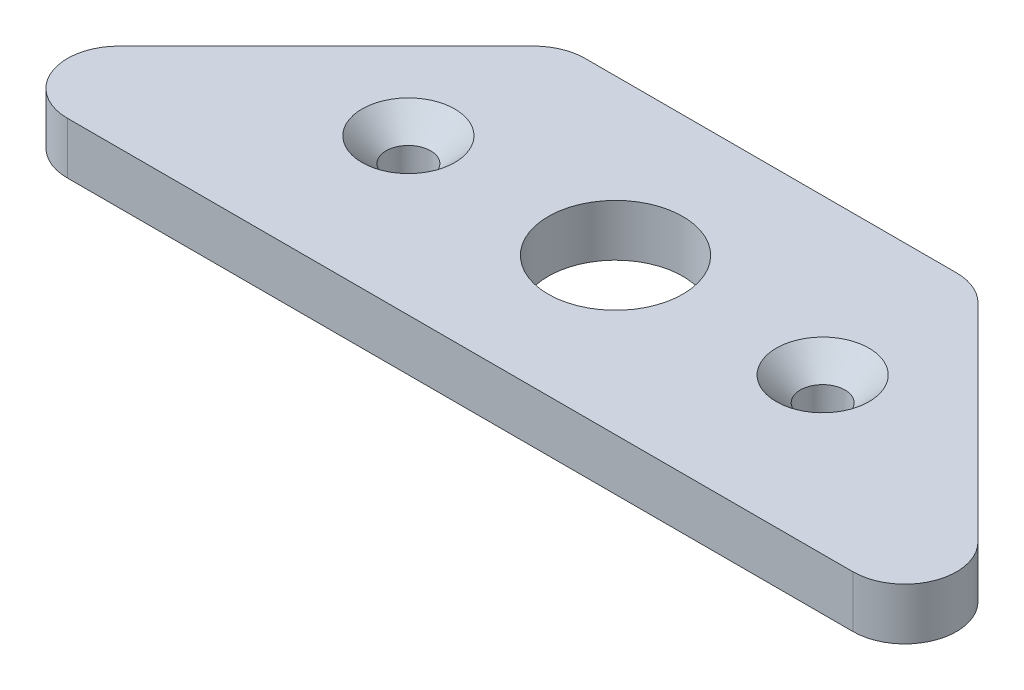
ISO-10303-21;
HEADER;
FILE_DESCRIPTION(('STEP AP214'),'2;1');
FILE_NAME('part.step','',(''),(''),'','','');
FILE_SCHEMA(('AUTOMOTIVE_DESIGN { 1 0 10303 214 1 1 1 1 }'));
ENDSEC;
DATA;
#1=APPLICATION_CONTEXT('core data for automotive mechanical design processes');
#2=APPLICATION_PROTOCOL_DEFINITION('international standard','automotive_design',2000,#1);
#3=PRODUCT_CONTEXT('',#1,'mechanical');
#4=PRODUCT('Part','Part','',(#3));
#5=PRODUCT_RELATED_PRODUCT_CATEGORY('part','',(#4));
#6=PRODUCT_DEFINITION_FORMATION('','',#4);
#7=PRODUCT_DEFINITION_CONTEXT('part definition',#1,'design');
#8=PRODUCT_DEFINITION('design','',#6,#7);
#9=PRODUCT_DEFINITION_SHAPE('','',#8);
#10=(LENGTH_UNIT() NAMED_UNIT(*) SI_UNIT(.MILLI.,.METRE.));
#11=(NAMED_UNIT(*) PLANE_ANGLE_UNIT() SI_UNIT($,.RADIAN.));
#12=(NAMED_UNIT(*) SI_UNIT($,.STERADIAN.) SOLID_ANGLE_UNIT());
#13=UNCERTAINTY_MEASURE_WITH_UNIT(LENGTH_MEASURE(1.E-05),#10,'distance_accuracy_value','');
#14=(GEOMETRIC_REPRESENTATION_CONTEXT(3) GLOBAL_UNCERTAINTY_ASSIGNED_CONTEXT((#13)) GLOBAL_UNIT_ASSIGNED_CONTEXT((#10,
#11,#12)) REPRESENTATION_CONTEXT('',''));
#15=CARTESIAN_POINT('',(0.,0.,0.));
#16=DIRECTION('',(0.,0.,1.));
#17=DIRECTION('',(1.,0.,0.));
#18=AXIS2_PLACEMENT_3D('',#15,#16,#17);
#19=CARTESIAN_POINT('',(0.,5.,0.));
#20=DIRECTION('',(0.,1.,0.));
#21=DIRECTION('',(0.,0.,1.));
#22=AXIS2_PLACEMENT_3D('',#19,#20,#21);
#23=PLANE('',#22);
#24=CARTESIAN_POINT('',(-20.,5.,0.));
#25=DIRECTION('',(0.,1.,0.));
#26=DIRECTION('',(0.,0.,1.));
#27=AXIS2_PLACEMENT_3D('',#24,#25,#26);
#28=CIRCLE('',#27,4.48);
#29=CARTESIAN_POINT('',(-20.,5.,4.48));
#30=VERTEX_POINT('',#29);
#31=EDGE_CURVE('E299',#30,#30,#28,.T.);
#32=ORIENTED_EDGE('',*,*,#31,.F.);
#33=EDGE_LOOP('',(#32));
#34=FACE_BOUND('',#33,.T.);
#35=CARTESIAN_POINT('',(20.,5.,0.));
#36=DIRECTION('',(0.,1.,0.));
#37=DIRECTION('',(0.,0.,1.));
#38=AXIS2_PLACEMENT_3D('',#35,#36,#37);
#39=CIRCLE('',#38,4.48);
#40=CARTESIAN_POINT('',(20.,5.,4.48));
#41=VERTEX_POINT('',#40);
#42=EDGE_CURVE('E174',#41,#41,#39,.T.);
#43=ORIENTED_EDGE('',*,*,#42,.F.);
#44=EDGE_LOOP('',(#43));
#45=FACE_BOUND('',#44,.T.);
#46=DIRECTION('',(-1.,0.,0.));
#47=VECTOR('',#46,1.);
#48=CARTESIAN_POINT('',(-20.,5.,-15.));
#49=LINE('',#48,#47);
#50=CARTESIAN_POINT('',(17.9289321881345,5.,-15.));
#51=VERTEX_POINT('',#50);
#52=CARTESIAN_POINT('',(-17.9289321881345,5.,-15.));
#53=VERTEX_POINT('',#52);
#54=EDGE_CURVE('E187',#51,#53,#49,.T.);
#55=ORIENTED_EDGE('',*,*,#54,.T.);
#56=CARTESIAN_POINT('',(-17.9289321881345,5.,-10.));
#57=DIRECTION('',(0.,1.,0.));
#58=DIRECTION('',(0.,0.,1.));
#59=AXIS2_PLACEMENT_3D('',#56,#57,#58);
#60=CIRCLE('',#59,5.);
#61=CARTESIAN_POINT('',(-21.4644660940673,5.,-13.5355339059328));
#62=VERTEX_POINT('',#61);
#63=EDGE_CURVE('E158',#53,#62,#60,.T.);
#64=ORIENTED_EDGE('',*,*,#63,.T.);
#65=DIRECTION('',(-0.707106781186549,0.,0.707106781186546));
#66=VECTOR('',#65,1.);
#67=CARTESIAN_POINT('',(-50.0000000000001,5.,15.));
#68=LINE('',#67,#66);
#69=CARTESIAN_POINT('',(-41.4644660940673,5.,6.46446609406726));
#70=VERTEX_POINT('',#69);
#71=EDGE_CURVE('E128',#62,#70,#68,.T.);
#72=ORIENTED_EDGE('',*,*,#71,.T.);
#73=CARTESIAN_POINT('',(-37.9289321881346,5.,10.));
#74=DIRECTION('',(0.,1.,0.));
#75=DIRECTION('',(0.,0.,1.));
#76=AXIS2_PLACEMENT_3D('',#73,#74,#75);
#77=CIRCLE('',#76,5.);
#78=CARTESIAN_POINT('',(-37.9289321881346,5.,15.));
#79=VERTEX_POINT('',#78);
#80=EDGE_CURVE('E154',#70,#79,#77,.T.);
#81=ORIENTED_EDGE('',*,*,#80,.T.);
#82=DIRECTION('',(1.,0.,0.));
#83=VECTOR('',#82,1.);
#84=CARTESIAN_POINT('',(-10.,5.,15.));
#85=LINE('',#84,#83);
#86=CARTESIAN_POINT('',(37.9289321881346,5.,15.));
#87=VERTEX_POINT('',#86);
#88=EDGE_CURVE('E140',#79,#87,#85,.T.);
#89=ORIENTED_EDGE('',*,*,#88,.T.);
#90=CARTESIAN_POINT('',(37.9289321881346,5.,9.99999999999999));
#91=DIRECTION('',(0.,1.,0.));
#92=DIRECTION('',(0.,0.,1.));
#93=AXIS2_PLACEMENT_3D('',#90,#91,#92);
#94=CIRCLE('',#93,5.);
#95=CARTESIAN_POINT('',(41.4644660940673,5.,6.46446609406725));
#96=VERTEX_POINT('',#95);
#97=EDGE_CURVE('E63',#87,#96,#94,.T.);
#98=ORIENTED_EDGE('',*,*,#97,.T.);
#99=DIRECTION('',(-0.707106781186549,0.,-0.707106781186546));
#100=VECTOR('',#99,1.);
#101=CARTESIAN_POINT('',(50.0000000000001,5.,15.));
#102=LINE('',#101,#100);
#103=CARTESIAN_POINT('',(21.4644660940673,5.,-13.5355339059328));
#104=VERTEX_POINT('',#103);
#105=EDGE_CURVE('E185',#96,#104,#102,.T.);
#106=ORIENTED_EDGE('',*,*,#105,.T.);
#107=CARTESIAN_POINT('',(17.9289321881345,5.,-10.));
#108=DIRECTION('',(0.,1.,0.));
#109=DIRECTION('',(0.,0.,1.));
#110=AXIS2_PLACEMENT_3D('',#107,#108,#109);
#111=CIRCLE('',#110,5.);
#112=EDGE_CURVE('E156',#104,#51,#111,.T.);
#113=ORIENTED_EDGE('',*,*,#112,.T.);
#114=EDGE_LOOP('',(#55,#64,#72,#81,#89,#98,#106,#113));
#115=FACE_BOUND('',#114,.T.);
#116=CARTESIAN_POINT('',(0.,5.,0.));
#117=DIRECTION('',(0.,1.,0.));
#118=DIRECTION('',(0.,0.,1.));
#119=AXIS2_PLACEMENT_3D('',#116,#117,#118);
#120=CIRCLE('',#119,6.5);
#121=CARTESIAN_POINT('',(0.,5.,6.5));
#122=VERTEX_POINT('',#121);
#123=EDGE_CURVE('E171',#122,#122,#120,.T.);
#124=ORIENTED_EDGE('',*,*,#123,.F.);
#125=EDGE_LOOP('',(#124));
#126=FACE_BOUND('',#125,.T.);
#127=ADVANCED_FACE('F39',(#34,#45,#115,#126),#23,.T.);
#128=CARTESIAN_POINT('',(0.,0.,0.));
#129=DIRECTION('',(0.,1.,0.));
#130=DIRECTION('',(0.,0.,1.));
#131=AXIS2_PLACEMENT_3D('',#128,#129,#130);
#132=PLANE('',#131);
#133=CARTESIAN_POINT('',(-20.,0.,0.));
#134=DIRECTION('',(0.,1.,0.));
#135=DIRECTION('',(0.,0.,1.));
#136=AXIS2_PLACEMENT_3D('',#133,#134,#135);
#137=CIRCLE('',#136,2.15);
#138=CARTESIAN_POINT('',(-20.,0.,2.15));
#139=VERTEX_POINT('',#138);
#140=EDGE_CURVE('E43',#139,#139,#137,.T.);
#141=ORIENTED_EDGE('',*,*,#140,.T.);
#142=EDGE_LOOP('',(#141));
#143=FACE_BOUND('',#142,.T.);
#144=CARTESIAN_POINT('',(20.,0.,0.));
#145=DIRECTION('',(0.,1.,0.));
#146=DIRECTION('',(0.,0.,1.));
#147=AXIS2_PLACEMENT_3D('',#144,#145,#146);
#148=CIRCLE('',#147,2.15);
#149=CARTESIAN_POINT('',(20.,0.,2.15));
#150=VERTEX_POINT('',#149);
#151=EDGE_CURVE('E164',#150,#150,#148,.T.);
#152=ORIENTED_EDGE('',*,*,#151,.T.);
#153=EDGE_LOOP('',(#152));
#154=FACE_BOUND('',#153,.T.);
#155=DIRECTION('',(-0.707106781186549,0.,0.707106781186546));
#156=VECTOR('',#155,1.);
#157=CARTESIAN_POINT('',(-50.0000000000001,0.,15.));
#158=LINE('',#157,#156);
#159=CARTESIAN_POINT('',(-21.4644660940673,0.,-13.5355339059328));
#160=VERTEX_POINT('',#159);
#161=CARTESIAN_POINT('',(-41.4644660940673,0.,6.46446609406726));
#162=VERTEX_POINT('',#161);
#163=EDGE_CURVE('E125',#160,#162,#158,.T.);
#164=ORIENTED_EDGE('',*,*,#163,.F.);
#165=CARTESIAN_POINT('',(-17.9289321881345,0.,-10.));
#166=DIRECTION('',(0.,1.,0.));
#167=DIRECTION('',(0.,0.,1.));
#168=AXIS2_PLACEMENT_3D('',#165,#166,#167);
#169=CIRCLE('',#168,5.);
#170=CARTESIAN_POINT('',(-17.9289321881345,0.,-15.));
#171=VERTEX_POINT('',#170);
#172=EDGE_CURVE('E108',#160,#171,#169,.F.);
#173=ORIENTED_EDGE('',*,*,#172,.T.);
#174=DIRECTION('',(-1.,0.,0.));
#175=VECTOR('',#174,1.);
#176=CARTESIAN_POINT('',(-20.,0.,-15.));
#177=LINE('',#176,#175);
#178=CARTESIAN_POINT('',(17.9289321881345,0.,-15.));
#179=VERTEX_POINT('',#178);
#180=EDGE_CURVE('E137',#179,#171,#177,.T.);
#181=ORIENTED_EDGE('',*,*,#180,.F.);
#182=CARTESIAN_POINT('',(17.9289321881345,0.,-10.));
#183=DIRECTION('',(0.,1.,0.));
#184=DIRECTION('',(0.,0.,1.));
#185=AXIS2_PLACEMENT_3D('',#182,#183,#184);
#186=CIRCLE('',#185,5.);
#187=CARTESIAN_POINT('',(21.4644660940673,0.,-13.5355339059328));
#188=VERTEX_POINT('',#187);
#189=EDGE_CURVE('E119',#179,#188,#186,.F.);
#190=ORIENTED_EDGE('',*,*,#189,.T.);
#191=DIRECTION('',(-0.707106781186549,0.,-0.707106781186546));
#192=VECTOR('',#191,1.);
#193=CARTESIAN_POINT('',(50.0000000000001,0.,15.));
#194=LINE('',#193,#192);
#195=CARTESIAN_POINT('',(41.4644660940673,0.,6.46446609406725));
#196=VERTEX_POINT('',#195);
#197=EDGE_CURVE('E142',#196,#188,#194,.T.);
#198=ORIENTED_EDGE('',*,*,#197,.F.);
#199=CARTESIAN_POINT('',(37.9289321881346,0.,9.99999999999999));
#200=DIRECTION('',(0.,1.,0.));
#201=DIRECTION('',(0.,0.,1.));
#202=AXIS2_PLACEMENT_3D('',#199,#200,#201);
#203=CIRCLE('',#202,5.);
#204=CARTESIAN_POINT('',(37.9289321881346,0.,15.));
#205=VERTEX_POINT('',#204);
#206=EDGE_CURVE('E129',#196,#205,#203,.F.);
#207=ORIENTED_EDGE('',*,*,#206,.T.);
#208=DIRECTION('',(1.,0.,0.));
#209=VECTOR('',#208,1.);
#210=CARTESIAN_POINT('',(-10.,0.,15.));
#211=LINE('',#210,#209);
#212=CARTESIAN_POINT('',(-37.9289321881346,0.,15.));
#213=VERTEX_POINT('',#212);
#214=EDGE_CURVE('E136',#213,#205,#211,.T.);
#215=ORIENTED_EDGE('',*,*,#214,.F.);
#216=CARTESIAN_POINT('',(-37.9289321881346,0.,10.));
#217=DIRECTION('',(0.,1.,0.));
#218=DIRECTION('',(0.,0.,1.));
#219=AXIS2_PLACEMENT_3D('',#216,#217,#218);
#220=CIRCLE('',#219,5.);
#221=EDGE_CURVE('E135',#213,#162,#220,.F.);
#222=ORIENTED_EDGE('',*,*,#221,.T.);
#223=EDGE_LOOP('',(#164,#173,#181,#190,#198,#207,#215,#222));
#224=FACE_BOUND('',#223,.T.);
#225=CARTESIAN_POINT('',(0.,0.,0.));
#226=DIRECTION('',(0.,1.,0.));
#227=DIRECTION('',(0.,0.,1.));
#228=AXIS2_PLACEMENT_3D('',#225,#226,#227);
#229=CIRCLE('',#228,6.5);
#230=CARTESIAN_POINT('',(0.,0.,6.5));
#231=VERTEX_POINT('',#230);
#232=EDGE_CURVE('E166',#231,#231,#229,.T.);
#233=ORIENTED_EDGE('',*,*,#232,.T.);
#234=EDGE_LOOP('',(#233));
#235=FACE_BOUND('',#234,.T.);
#236=ADVANCED_FACE('F132',(#143,#154,#224,#235),#132,.F.);
#237=CARTESIAN_POINT('',(50.0000000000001,5.,15.));
#238=DIRECTION('',(-0.707106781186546,0.,0.707106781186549));
#239=DIRECTION('',(0.707106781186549,0.,0.707106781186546));
#240=AXIS2_PLACEMENT_3D('',#237,#238,#239);
#241=PLANE('',#240);
#242=ORIENTED_EDGE('',*,*,#197,.T.);
#243=DIRECTION('',(0.,-1.,0.));
#244=VECTOR('',#243,1.);
#245=CARTESIAN_POINT('',(21.4644660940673,5.,-13.5355339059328));
#246=LINE('',#245,#244);
#247=EDGE_CURVE('E56',#188,#104,#246,.F.);
#248=ORIENTED_EDGE('',*,*,#247,.T.);
#249=ORIENTED_EDGE('',*,*,#105,.F.);
#250=DIRECTION('',(0.,-1.,0.));
#251=VECTOR('',#250,1.);
#252=CARTESIAN_POINT('',(41.4644660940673,5.,6.46446609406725));
#253=LINE('',#252,#251);
#254=EDGE_CURVE('E160',#96,#196,#253,.T.);
#255=ORIENTED_EDGE('',*,*,#254,.T.);
#256=EDGE_LOOP('',(#242,#248,#249,#255));
#257=FACE_BOUND('',#256,.T.);
#258=ADVANCED_FACE('F191',(#257),#241,.F.);
#259=CARTESIAN_POINT('',(-20.,5.,-15.));
#260=DIRECTION('',(0.,0.,1.));
#261=DIRECTION('',(1.,0.,0.));
#262=AXIS2_PLACEMENT_3D('',#259,#260,#261);
#263=PLANE('',#262);
#264=ORIENTED_EDGE('',*,*,#180,.T.);
#265=DIRECTION('',(0.,-1.,0.));
#266=VECTOR('',#265,1.);
#267=CARTESIAN_POINT('',(-17.9289321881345,5.,-15.));
#268=LINE('',#267,#266);
#269=EDGE_CURVE('E113',#171,#53,#268,.F.);
#270=ORIENTED_EDGE('',*,*,#269,.T.);
#271=ORIENTED_EDGE('',*,*,#54,.F.);
#272=DIRECTION('',(0.,-1.,0.));
#273=VECTOR('',#272,1.);
#274=CARTESIAN_POINT('',(17.9289321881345,5.,-15.));
#275=LINE('',#274,#273);
#276=EDGE_CURVE('E118',#51,#179,#275,.T.);
#277=ORIENTED_EDGE('',*,*,#276,.T.);
#278=EDGE_LOOP('',(#264,#270,#271,#277));
#279=FACE_BOUND('',#278,.T.);
#280=ADVANCED_FACE('F200',(#279),#263,.F.);
#281=CARTESIAN_POINT('',(-50.0000000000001,5.,15.));
#282=DIRECTION('',(0.707106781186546,0.,0.707106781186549));
#283=DIRECTION('',(0.707106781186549,0.,-0.707106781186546));
#284=AXIS2_PLACEMENT_3D('',#281,#282,#283);
#285=PLANE('',#284);
#286=ORIENTED_EDGE('',*,*,#71,.F.);
#287=DIRECTION('',(0.,-1.,0.));
#288=VECTOR('',#287,1.);
#289=CARTESIAN_POINT('',(-21.4644660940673,5.,-13.5355339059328));
#290=LINE('',#289,#288);
#291=EDGE_CURVE('E112',#62,#160,#290,.T.);
#292=ORIENTED_EDGE('',*,*,#291,.T.);
#293=ORIENTED_EDGE('',*,*,#163,.T.);
#294=DIRECTION('',(0.,-1.,0.));
#295=VECTOR('',#294,1.);
#296=CARTESIAN_POINT('',(-41.4644660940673,5.,6.46446609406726));
#297=LINE('',#296,#295);
#298=EDGE_CURVE('E130',#162,#70,#297,.F.);
#299=ORIENTED_EDGE('',*,*,#298,.T.);
#300=EDGE_LOOP('',(#286,#292,#293,#299));
#301=FACE_BOUND('',#300,.T.);
#302=ADVANCED_FACE('F124',(#301),#285,.F.);
#303=CARTESIAN_POINT('',(-10.,5.,15.));
#304=DIRECTION('',(0.,0.,-1.));
#305=DIRECTION('',(-1.,0.,0.));
#306=AXIS2_PLACEMENT_3D('',#303,#304,#305);
#307=PLANE('',#306);
#308=ORIENTED_EDGE('',*,*,#88,.F.);
#309=DIRECTION('',(0.,-1.,0.));
#310=VECTOR('',#309,1.);
#311=CARTESIAN_POINT('',(-37.9289321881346,5.,15.));
#312=LINE('',#311,#310);
#313=EDGE_CURVE('E11',#79,#213,#312,.T.);
#314=ORIENTED_EDGE('',*,*,#313,.T.);
#315=ORIENTED_EDGE('',*,*,#214,.T.);
#316=DIRECTION('',(0.,-1.,0.));
#317=VECTOR('',#316,1.);
#318=CARTESIAN_POINT('',(37.9289321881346,5.,15.));
#319=LINE('',#318,#317);
#320=EDGE_CURVE('E48',#205,#87,#319,.F.);
#321=ORIENTED_EDGE('',*,*,#320,.T.);
#322=EDGE_LOOP('',(#308,#314,#315,#321));
#323=FACE_BOUND('',#322,.T.);
#324=ADVANCED_FACE('F207',(#323),#307,.F.);
#325=CARTESIAN_POINT('',(0.,5.,0.));
#326=DIRECTION('',(0.,-1.,0.));
#327=DIRECTION('',(0.,0.,-1.));
#328=AXIS2_PLACEMENT_3D('',#325,#326,#327);
#329=CYLINDRICAL_SURFACE('',#328,6.5);
#330=ORIENTED_EDGE('',*,*,#123,.T.);
#331=EDGE_LOOP('',(#330));
#332=FACE_BOUND('',#331,.T.);
#333=ORIENTED_EDGE('',*,*,#232,.F.);
#334=EDGE_LOOP('',(#333));
#335=FACE_BOUND('',#334,.T.);
#336=ADVANCED_FACE('F222',(#332,#335),#329,.F.);
#337=CARTESIAN_POINT('',(-17.9289321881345,5.,-10.));
#338=DIRECTION('',(0.,-1.,0.));
#339=DIRECTION('',(0.,0.,-1.));
#340=AXIS2_PLACEMENT_3D('',#337,#338,#339);
#341=CYLINDRICAL_SURFACE('',#340,5.);
#342=ORIENTED_EDGE('',*,*,#63,.F.);
#343=ORIENTED_EDGE('',*,*,#269,.F.);
#344=ORIENTED_EDGE('',*,*,#172,.F.);
#345=ORIENTED_EDGE('',*,*,#291,.F.);
#346=EDGE_LOOP('',(#342,#343,#344,#345));
#347=FACE_BOUND('',#346,.T.);
#348=ADVANCED_FACE('F111',(#347),#341,.T.);
#349=CARTESIAN_POINT('',(17.9289321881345,5.,-10.));
#350=DIRECTION('',(0.,-1.,0.));
#351=DIRECTION('',(0.,0.,-1.));
#352=AXIS2_PLACEMENT_3D('',#349,#350,#351);
#353=CYLINDRICAL_SURFACE('',#352,5.);
#354=ORIENTED_EDGE('',*,*,#112,.F.);
#355=ORIENTED_EDGE('',*,*,#247,.F.);
#356=ORIENTED_EDGE('',*,*,#189,.F.);
#357=ORIENTED_EDGE('',*,*,#276,.F.);
#358=EDGE_LOOP('',(#354,#355,#356,#357));
#359=FACE_BOUND('',#358,.T.);
#360=ADVANCED_FACE('F195',(#359),#353,.T.);
#361=CARTESIAN_POINT('',(-37.9289321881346,5.,10.));
#362=DIRECTION('',(0.,-1.,0.));
#363=DIRECTION('',(0.,0.,-1.));
#364=AXIS2_PLACEMENT_3D('',#361,#362,#363);
#365=CYLINDRICAL_SURFACE('',#364,5.);
#366=ORIENTED_EDGE('',*,*,#80,.F.);
#367=ORIENTED_EDGE('',*,*,#298,.F.);
#368=ORIENTED_EDGE('',*,*,#221,.F.);
#369=ORIENTED_EDGE('',*,*,#313,.F.);
#370=EDGE_LOOP('',(#366,#367,#368,#369));
#371=FACE_BOUND('',#370,.T.);
#372=ADVANCED_FACE('F237',(#371),#365,.T.);
#373=CARTESIAN_POINT('',(37.9289321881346,5.,9.99999999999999));
#374=DIRECTION('',(0.,-1.,0.));
#375=DIRECTION('',(0.,0.,-1.));
#376=AXIS2_PLACEMENT_3D('',#373,#374,#375);
#377=CYLINDRICAL_SURFACE('',#376,5.);
#378=ORIENTED_EDGE('',*,*,#97,.F.);
#379=ORIENTED_EDGE('',*,*,#320,.F.);
#380=ORIENTED_EDGE('',*,*,#206,.F.);
#381=ORIENTED_EDGE('',*,*,#254,.F.);
#382=EDGE_LOOP('',(#378,#379,#380,#381));
#383=FACE_BOUND('',#382,.T.);
#384=ADVANCED_FACE('F41',(#383),#377,.T.);
#385=CARTESIAN_POINT('',(20.,5.,0.));
#386=DIRECTION('',(0.,1.,0.));
#387=DIRECTION('',(0.,0.,1.));
#388=AXIS2_PLACEMENT_3D('',#385,#386,#387);
#389=CYLINDRICAL_SURFACE('',#388,2.15);
#390=CARTESIAN_POINT('',(20.,2.67,0.));
#391=DIRECTION('',(0.,1.,0.));
#392=DIRECTION('',(0.,0.,1.));
#393=AXIS2_PLACEMENT_3D('',#390,#391,#392);
#394=CIRCLE('',#393,2.15);
#395=CARTESIAN_POINT('',(20.,2.67,2.15));
#396=VERTEX_POINT('',#395);
#397=EDGE_CURVE('E167',#396,#396,#394,.T.);
#398=ORIENTED_EDGE('',*,*,#397,.T.);
#399=EDGE_LOOP('',(#398));
#400=FACE_BOUND('',#399,.T.);
#401=ORIENTED_EDGE('',*,*,#151,.F.);
#402=EDGE_LOOP('',(#401));
#403=FACE_BOUND('',#402,.T.);
#404=ADVANCED_FACE('F242',(#400,#403),#389,.F.);
#405=CARTESIAN_POINT('',(20.,5.,0.));
#406=DIRECTION('',(0.,1.,0.));
#407=DIRECTION('',(0.,0.,1.));
#408=AXIS2_PLACEMENT_3D('',#405,#406,#407);
#409=CONICAL_SURFACE('',#408,4.48,0.785398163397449);
#410=ORIENTED_EDGE('',*,*,#397,.F.);
#411=EDGE_LOOP('',(#410));
#412=FACE_BOUND('',#411,.T.);
#413=ORIENTED_EDGE('',*,*,#42,.T.);
#414=EDGE_LOOP('',(#413));
#415=FACE_BOUND('',#414,.T.);
#416=ADVANCED_FACE('F266',(#412,#415),#409,.F.);
#417=CARTESIAN_POINT('',(-20.,5.,0.));
#418=DIRECTION('',(0.,1.,0.));
#419=DIRECTION('',(0.,0.,1.));
#420=AXIS2_PLACEMENT_3D('',#417,#418,#419);
#421=CYLINDRICAL_SURFACE('',#420,2.15);
#422=CARTESIAN_POINT('',(-20.,2.67,0.));
#423=DIRECTION('',(0.,1.,0.));
#424=DIRECTION('',(0.,0.,1.));
#425=AXIS2_PLACEMENT_3D('',#422,#423,#424);
#426=CIRCLE('',#425,2.15);
#427=CARTESIAN_POINT('',(-20.,2.67,2.15));
#428=VERTEX_POINT('',#427);
#429=EDGE_CURVE('E297',#428,#428,#426,.T.);
#430=ORIENTED_EDGE('',*,*,#429,.T.);
#431=EDGE_LOOP('',(#430));
#432=FACE_BOUND('',#431,.T.);
#433=ORIENTED_EDGE('',*,*,#140,.F.);
#434=EDGE_LOOP('',(#433));
#435=FACE_BOUND('',#434,.T.);
#436=ADVANCED_FACE('F273',(#432,#435),#421,.F.);
#437=CARTESIAN_POINT('',(-20.,5.,0.));
#438=DIRECTION('',(0.,1.,0.));
#439=DIRECTION('',(0.,0.,1.));
#440=AXIS2_PLACEMENT_3D('',#437,#438,#439);
#441=CONICAL_SURFACE('',#440,4.48,0.785398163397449);
#442=ORIENTED_EDGE('',*,*,#429,.F.);
#443=EDGE_LOOP('',(#442));
#444=FACE_BOUND('',#443,.T.);
#445=ORIENTED_EDGE('',*,*,#31,.T.);
#446=EDGE_LOOP('',(#445));
#447=FACE_BOUND('',#446,.T.);
#448=ADVANCED_FACE('F281',(#444,#447),#441,.F.);
#449=CLOSED_SHELL('',(#127,#236,#258,#280,#302,#324,#336,#348,#360,#372,#384,#404,#416,#436,#448));
#450=MANIFOLD_SOLID_BREP('B2',#449);
#451=ADVANCED_BREP_SHAPE_REPRESENTATION('',(#18,#450),#14);
#452=SHAPE_DEFINITION_REPRESENTATION(#9,#451);
ENDSEC;
END-ISO-10303-21;
